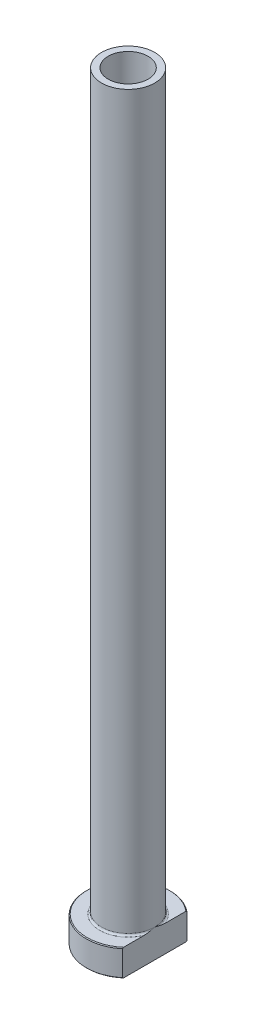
from build123d import *

# Parameters (mm, degrees)
FILLET1_R          = 0.5
CHAMFER1_SIZE      = 0.2
CUT_EXTRUDE1_DEPTH = 201.604087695
CHAMFER2_SIZE      = 0.5


with BuildPart() as part:
    # Sketch1 → Revolve1 (revolve)
    with BuildSketch(Plane.XY, mode=Mode.PRIVATE) as revolve1_sk:
        Polygon((-5.25, 200), (-7, 200), (-7, 7), (-11, 7), (-11, 0), (-5.5, 0), (-5.5, 133), (-5.25, 145), align=None)
    revolve(revolve1_sk.sketch.rotate(Axis((0, 92.187680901, 0), (0, -1, 0)), 270), axis=Axis((0, 92.187680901, 0), (0, -1, 0)))

    # Fillet1
    fillet1_edges = [part.edges().sort_by_distance(p)[0] for p in [
        (0, 7, -7),
    ]]
    fillet(fillet1_edges, radius=FILLET1_R)

    # Chamfer1
    chamfer1_edges = [part.edges().sort_by_distance(p)[0] for p in [
        (0, 0, -11),
        (0, 7, -11),
    ]]
    chamfer(chamfer1_edges, length=CHAMFER1_SIZE)

    # Sketch2 → Cut-Extrude1 (cut, through all)
    with BuildSketch(Plane.XZ):
        with BuildLine():
            Line((7, 8.485281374), (7, -8.485281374))
            ThreePointArc((7, -8.485281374), (11, 0), (7, 8.485281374))
        make_face()
    extrude(amount=-CUT_EXTRUDE1_DEPTH, mode=Mode.SUBTRACT)

    # Chamfer2
    chamfer2_edges = [part.edges().sort_by_distance(p)[0] for p in [
        (0, 0, -5.5),
    ]]
    chamfer(chamfer2_edges, length=CHAMFER2_SIZE)


solid = part.part
